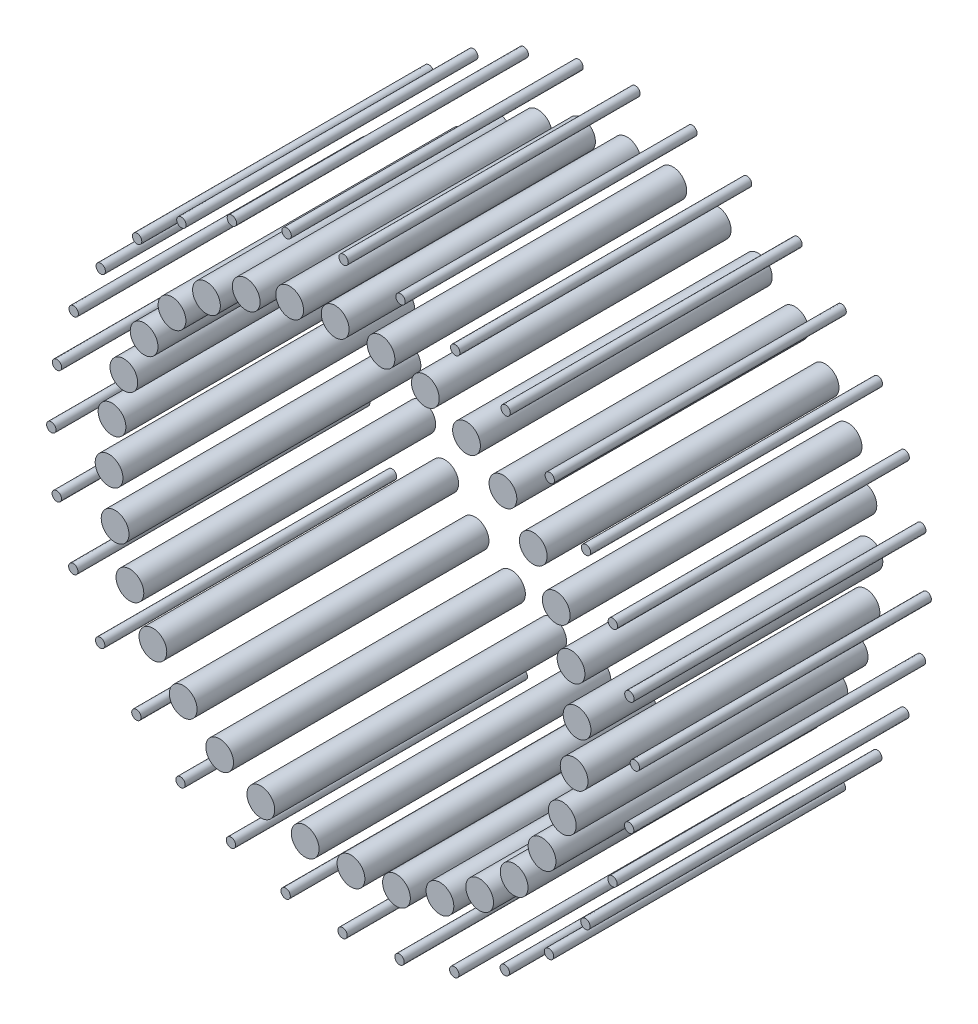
from build123d import *

# Parameters (mm, degrees)
SKETCH1_R             = 11.890806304
BOSS_EXTRUDE1_DEPTH   = 250
SKETCH1_R_2           = 4.006668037
BOSS_EXTRUDE1_2_DEPTH = 250
CIRPATTERN1_COUNT     = 32


with BuildPart() as part:
    # Sketch1 → Boss-Extrude1 (new body)
    with BuildSketch(Plane.XY):
        with Locations((-82.964624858, 182.591048)):
            Circle(SKETCH1_R)
    extrude(amount=BOSS_EXTRUDE1_DEPTH)


with BuildPart() as body_2:
    # Sketch1 → Boss-Extrude1 2 (new body)
    with BuildSketch(Plane.XY):
        with Locations((-138.489499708, 208.058571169)):
            Circle(SKETCH1_R_2)
    extrude(amount=BOSS_EXTRUDE1_2_DEPTH)


with BuildPart() as cirpattern1_1:
    # CirPattern1: pattern copy
    add(body_2.part.rotate(Axis((0, 0, 0), (0, 0, 1)), 1 * 360 / CIRPATTERN1_COUNT))


with BuildPart() as cirpattern1_2:
    # CirPattern1: pattern copy
    add(body_2.part.rotate(Axis((0, 0, 0), (0, 0, 1)), 2 * 360 / CIRPATTERN1_COUNT))


with BuildPart() as cirpattern1_3:
    # CirPattern1: pattern copy
    add(body_2.part.rotate(Axis((0, 0, 0), (0, 0, 1)), 3 * 360 / CIRPATTERN1_COUNT))


with BuildPart() as cirpattern1_4:
    # CirPattern1: pattern copy
    add(body_2.part.rotate(Axis((0, 0, 0), (0, 0, 1)), 4 * 360 / CIRPATTERN1_COUNT))


with BuildPart() as cirpattern1_5:
    # CirPattern1: pattern copy
    add(body_2.part.rotate(Axis((0, 0, 0), (0, 0, 1)), 5 * 360 / CIRPATTERN1_COUNT))


with BuildPart() as cirpattern1_6:
    # CirPattern1: pattern copy
    add(body_2.part.rotate(Axis((0, 0, 0), (0, 0, 1)), 6 * 360 / CIRPATTERN1_COUNT))


with BuildPart() as cirpattern1_7:
    # CirPattern1: pattern copy
    add(body_2.part.rotate(Axis((0, 0, 0), (0, 0, 1)), 7 * 360 / CIRPATTERN1_COUNT))


with BuildPart() as cirpattern1_8:
    # CirPattern1: pattern copy
    add(body_2.part.rotate(Axis((0, 0, 0), (0, 0, 1)), 8 * 360 / CIRPATTERN1_COUNT))


with BuildPart() as cirpattern1_9:
    # CirPattern1: pattern copy
    add(body_2.part.rotate(Axis((0, 0, 0), (0, 0, 1)), 9 * 360 / CIRPATTERN1_COUNT))


with BuildPart() as cirpattern1_10:
    # CirPattern1: pattern copy
    add(body_2.part.rotate(Axis((0, 0, 0), (0, 0, 1)), 10 * 360 / CIRPATTERN1_COUNT))


with BuildPart() as cirpattern1_11:
    # CirPattern1: pattern copy
    add(body_2.part.rotate(Axis((0, 0, 0), (0, 0, 1)), 11 * 360 / CIRPATTERN1_COUNT))


with BuildPart() as cirpattern1_12:
    # CirPattern1: pattern copy
    add(body_2.part.rotate(Axis((0, 0, 0), (0, 0, 1)), 12 * 360 / CIRPATTERN1_COUNT))


with BuildPart() as cirpattern1_13:
    # CirPattern1: pattern copy
    add(body_2.part.rotate(Axis((0, 0, 0), (0, 0, 1)), 13 * 360 / CIRPATTERN1_COUNT))


with BuildPart() as cirpattern1_14:
    # CirPattern1: pattern copy
    add(body_2.part.rotate(Axis((0, 0, 0), (0, 0, 1)), 14 * 360 / CIRPATTERN1_COUNT))


with BuildPart() as cirpattern1_15:
    # CirPattern1: pattern copy
    add(body_2.part.rotate(Axis((0, 0, 0), (0, 0, 1)), 15 * 360 / CIRPATTERN1_COUNT))


with BuildPart() as cirpattern1_16:
    # CirPattern1: pattern copy
    add(body_2.part.rotate(Axis((0, 0, 0), (0, 0, 1)), 16 * 360 / CIRPATTERN1_COUNT))


with BuildPart() as cirpattern1_17:
    # CirPattern1: pattern copy
    add(body_2.part.rotate(Axis((0, 0, 0), (0, 0, 1)), 17 * 360 / CIRPATTERN1_COUNT))


with BuildPart() as cirpattern1_18:
    # CirPattern1: pattern copy
    add(body_2.part.rotate(Axis((0, 0, 0), (0, 0, 1)), 18 * 360 / CIRPATTERN1_COUNT))


with BuildPart() as cirpattern1_19:
    # CirPattern1: pattern copy
    add(body_2.part.rotate(Axis((0, 0, 0), (0, 0, 1)), 19 * 360 / CIRPATTERN1_COUNT))


with BuildPart() as cirpattern1_20:
    # CirPattern1: pattern copy
    add(body_2.part.rotate(Axis((0, 0, 0), (0, 0, 1)), 20 * 360 / CIRPATTERN1_COUNT))


with BuildPart() as cirpattern1_21:
    # CirPattern1: pattern copy
    add(body_2.part.rotate(Axis((0, 0, 0), (0, 0, 1)), 21 * 360 / CIRPATTERN1_COUNT))


with BuildPart() as cirpattern1_22:
    # CirPattern1: pattern copy
    add(body_2.part.rotate(Axis((0, 0, 0), (0, 0, 1)), 22 * 360 / CIRPATTERN1_COUNT))


with BuildPart() as cirpattern1_23:
    # CirPattern1: pattern copy
    add(body_2.part.rotate(Axis((0, 0, 0), (0, 0, 1)), 23 * 360 / CIRPATTERN1_COUNT))


with BuildPart() as cirpattern1_24:
    # CirPattern1: pattern copy
    add(body_2.part.rotate(Axis((0, 0, 0), (0, 0, 1)), 24 * 360 / CIRPATTERN1_COUNT))


with BuildPart() as cirpattern1_25:
    # CirPattern1: pattern copy
    add(body_2.part.rotate(Axis((0, 0, 0), (0, 0, 1)), 25 * 360 / CIRPATTERN1_COUNT))


with BuildPart() as cirpattern1_26:
    # CirPattern1: pattern copy
    add(body_2.part.rotate(Axis((0, 0, 0), (0, 0, 1)), 26 * 360 / CIRPATTERN1_COUNT))


with BuildPart() as cirpattern1_27:
    # CirPattern1: pattern copy
    add(body_2.part.rotate(Axis((0, 0, 0), (0, 0, 1)), 27 * 360 / CIRPATTERN1_COUNT))


with BuildPart() as cirpattern1_28:
    # CirPattern1: pattern copy
    add(body_2.part.rotate(Axis((0, 0, 0), (0, 0, 1)), 28 * 360 / CIRPATTERN1_COUNT))


with BuildPart() as cirpattern1_29:
    # CirPattern1: pattern copy
    add(body_2.part.rotate(Axis((0, 0, 0), (0, 0, 1)), 29 * 360 / CIRPATTERN1_COUNT))


with BuildPart() as cirpattern1_30:
    # CirPattern1: pattern copy
    add(body_2.part.rotate(Axis((0, 0, 0), (0, 0, 1)), 30 * 360 / CIRPATTERN1_COUNT))


with BuildPart() as cirpattern1_31:
    # CirPattern1: pattern copy
    add(body_2.part.rotate(Axis((0, 0, 0), (0, 0, 1)), 31 * 360 / CIRPATTERN1_COUNT))


with BuildPart() as cirpattern1_32:
    # CirPattern1: pattern copy
    add(part.part.rotate(Axis((0, 0, 0), (0, 0, 1)), 1 * 360 / CIRPATTERN1_COUNT))


with BuildPart() as cirpattern1_33:
    # CirPattern1: pattern copy
    add(part.part.rotate(Axis((0, 0, 0), (0, 0, 1)), 2 * 360 / CIRPATTERN1_COUNT))


with BuildPart() as cirpattern1_34:
    # CirPattern1: pattern copy
    add(part.part.rotate(Axis((0, 0, 0), (0, 0, 1)), 3 * 360 / CIRPATTERN1_COUNT))


with BuildPart() as cirpattern1_35:
    # CirPattern1: pattern copy
    add(part.part.rotate(Axis((0, 0, 0), (0, 0, 1)), 4 * 360 / CIRPATTERN1_COUNT))


with BuildPart() as cirpattern1_36:
    # CirPattern1: pattern copy
    add(part.part.rotate(Axis((0, 0, 0), (0, 0, 1)), 5 * 360 / CIRPATTERN1_COUNT))


with BuildPart() as cirpattern1_37:
    # CirPattern1: pattern copy
    add(part.part.rotate(Axis((0, 0, 0), (0, 0, 1)), 6 * 360 / CIRPATTERN1_COUNT))


with BuildPart() as cirpattern1_38:
    # CirPattern1: pattern copy
    add(part.part.rotate(Axis((0, 0, 0), (0, 0, 1)), 7 * 360 / CIRPATTERN1_COUNT))


with BuildPart() as cirpattern1_39:
    # CirPattern1: pattern copy
    add(part.part.rotate(Axis((0, 0, 0), (0, 0, 1)), 8 * 360 / CIRPATTERN1_COUNT))


with BuildPart() as cirpattern1_40:
    # CirPattern1: pattern copy
    add(part.part.rotate(Axis((0, 0, 0), (0, 0, 1)), 9 * 360 / CIRPATTERN1_COUNT))


with BuildPart() as cirpattern1_41:
    # CirPattern1: pattern copy
    add(part.part.rotate(Axis((0, 0, 0), (0, 0, 1)), 10 * 360 / CIRPATTERN1_COUNT))


with BuildPart() as cirpattern1_42:
    # CirPattern1: pattern copy
    add(part.part.rotate(Axis((0, 0, 0), (0, 0, 1)), 11 * 360 / CIRPATTERN1_COUNT))


with BuildPart() as cirpattern1_43:
    # CirPattern1: pattern copy
    add(part.part.rotate(Axis((0, 0, 0), (0, 0, 1)), 12 * 360 / CIRPATTERN1_COUNT))


with BuildPart() as cirpattern1_44:
    # CirPattern1: pattern copy
    add(part.part.rotate(Axis((0, 0, 0), (0, 0, 1)), 13 * 360 / CIRPATTERN1_COUNT))


with BuildPart() as cirpattern1_45:
    # CirPattern1: pattern copy
    add(part.part.rotate(Axis((0, 0, 0), (0, 0, 1)), 14 * 360 / CIRPATTERN1_COUNT))


with BuildPart() as cirpattern1_46:
    # CirPattern1: pattern copy
    add(part.part.rotate(Axis((0, 0, 0), (0, 0, 1)), 15 * 360 / CIRPATTERN1_COUNT))


with BuildPart() as cirpattern1_47:
    # CirPattern1: pattern copy
    add(part.part.rotate(Axis((0, 0, 0), (0, 0, 1)), 16 * 360 / CIRPATTERN1_COUNT))


with BuildPart() as cirpattern1_48:
    # CirPattern1: pattern copy
    add(part.part.rotate(Axis((0, 0, 0), (0, 0, 1)), 17 * 360 / CIRPATTERN1_COUNT))


with BuildPart() as cirpattern1_49:
    # CirPattern1: pattern copy
    add(part.part.rotate(Axis((0, 0, 0), (0, 0, 1)), 18 * 360 / CIRPATTERN1_COUNT))


with BuildPart() as cirpattern1_50:
    # CirPattern1: pattern copy
    add(part.part.rotate(Axis((0, 0, 0), (0, 0, 1)), 19 * 360 / CIRPATTERN1_COUNT))


with BuildPart() as cirpattern1_51:
    # CirPattern1: pattern copy
    add(part.part.rotate(Axis((0, 0, 0), (0, 0, 1)), 20 * 360 / CIRPATTERN1_COUNT))


with BuildPart() as cirpattern1_52:
    # CirPattern1: pattern copy
    add(part.part.rotate(Axis((0, 0, 0), (0, 0, 1)), 21 * 360 / CIRPATTERN1_COUNT))


with BuildPart() as cirpattern1_53:
    # CirPattern1: pattern copy
    add(part.part.rotate(Axis((0, 0, 0), (0, 0, 1)), 22 * 360 / CIRPATTERN1_COUNT))


with BuildPart() as cirpattern1_54:
    # CirPattern1: pattern copy
    add(part.part.rotate(Axis((0, 0, 0), (0, 0, 1)), 23 * 360 / CIRPATTERN1_COUNT))


with BuildPart() as cirpattern1_55:
    # CirPattern1: pattern copy
    add(part.part.rotate(Axis((0, 0, 0), (0, 0, 1)), 24 * 360 / CIRPATTERN1_COUNT))


with BuildPart() as cirpattern1_56:
    # CirPattern1: pattern copy
    add(part.part.rotate(Axis((0, 0, 0), (0, 0, 1)), 25 * 360 / CIRPATTERN1_COUNT))


with BuildPart() as cirpattern1_57:
    # CirPattern1: pattern copy
    add(part.part.rotate(Axis((0, 0, 0), (0, 0, 1)), 26 * 360 / CIRPATTERN1_COUNT))


with BuildPart() as cirpattern1_58:
    # CirPattern1: pattern copy
    add(part.part.rotate(Axis((0, 0, 0), (0, 0, 1)), 27 * 360 / CIRPATTERN1_COUNT))


with BuildPart() as cirpattern1_59:
    # CirPattern1: pattern copy
    add(part.part.rotate(Axis((0, 0, 0), (0, 0, 1)), 28 * 360 / CIRPATTERN1_COUNT))


with BuildPart() as cirpattern1_60:
    # CirPattern1: pattern copy
    add(part.part.rotate(Axis((0, 0, 0), (0, 0, 1)), 29 * 360 / CIRPATTERN1_COUNT))


with BuildPart() as cirpattern1_61:
    # CirPattern1: pattern copy
    add(part.part.rotate(Axis((0, 0, 0), (0, 0, 1)), 30 * 360 / CIRPATTERN1_COUNT))


with BuildPart() as cirpattern1_62:
    # CirPattern1: pattern copy
    add(part.part.rotate(Axis((0, 0, 0), (0, 0, 1)), 31 * 360 / CIRPATTERN1_COUNT))


solid = Compound([part.part, body_2.part, cirpattern1_1.part, cirpattern1_2.part, cirpattern1_3.part, cirpattern1_4.part, cirpattern1_5.part, cirpattern1_6.part, cirpattern1_7.part, cirpattern1_8.part, cirpattern1_9.part, cirpattern1_10.part, cirpattern1_11.part, cirpattern1_12.part, cirpattern1_13.part, cirpattern1_14.part, cirpattern1_15.part, cirpattern1_16.part, cirpattern1_17.part, cirpattern1_18.part, cirpattern1_19.part, cirpattern1_20.part, cirpattern1_21.part, cirpattern1_22.part, cirpattern1_23.part, cirpattern1_24.part, cirpattern1_25.part, cirpattern1_26.part, cirpattern1_27.part, cirpattern1_28.part, cirpattern1_29.part, cirpattern1_30.part, cirpattern1_31.part, cirpattern1_32.part, cirpattern1_33.part, cirpattern1_34.part, cirpattern1_35.part, cirpattern1_36.part, cirpattern1_37.part, cirpattern1_38.part, cirpattern1_39.part, cirpattern1_40.part, cirpattern1_41.part, cirpattern1_42.part, cirpattern1_43.part, cirpattern1_44.part, cirpattern1_45.part, cirpattern1_46.part, cirpattern1_47.part, cirpattern1_48.part, cirpattern1_49.part, cirpattern1_50.part, cirpattern1_51.part, cirpattern1_52.part, cirpattern1_53.part, cirpattern1_54.part, cirpattern1_55.part, cirpattern1_56.part, cirpattern1_57.part, cirpattern1_58.part, cirpattern1_59.part, cirpattern1_60.part, cirpattern1_61.part, cirpattern1_62.part])
